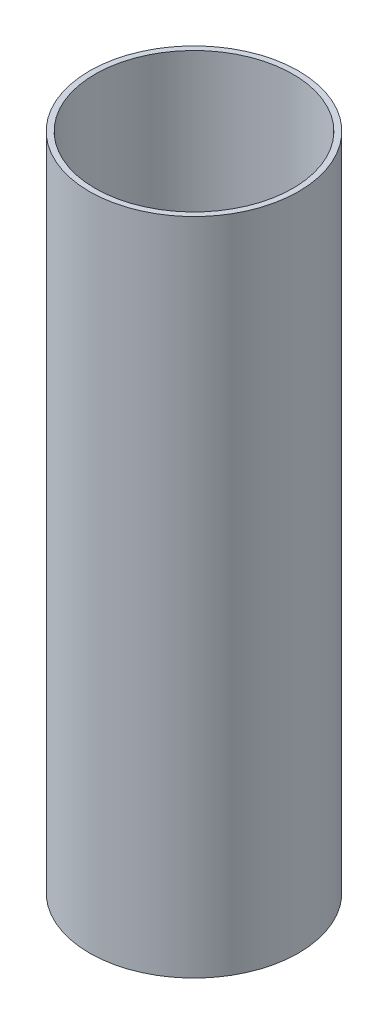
from build123d import *

# Parameters (mm, degrees)
SKETCH1_R           = 80.518
SKETCH1_R_2         = 76.2
BOSS_EXTRUDE1_DEPTH = 508


with BuildPart() as part:
    # Sketch1 → Boss-Extrude1 (new body)
    with BuildSketch(Plane(origin=(0, 0, 0), x_dir=(1, 0, 0), z_dir=(0, 1, 0))):
        with Locations(Location((0, 0, 0), (0, 0, 270))):
            Circle(SKETCH1_R)
        with Locations(Location((0, 0, 0), (0, 0, 270))):
            Circle(SKETCH1_R_2, mode=Mode.SUBTRACT)
    extrude(amount=BOSS_EXTRUDE1_DEPTH)


solid = part.part
